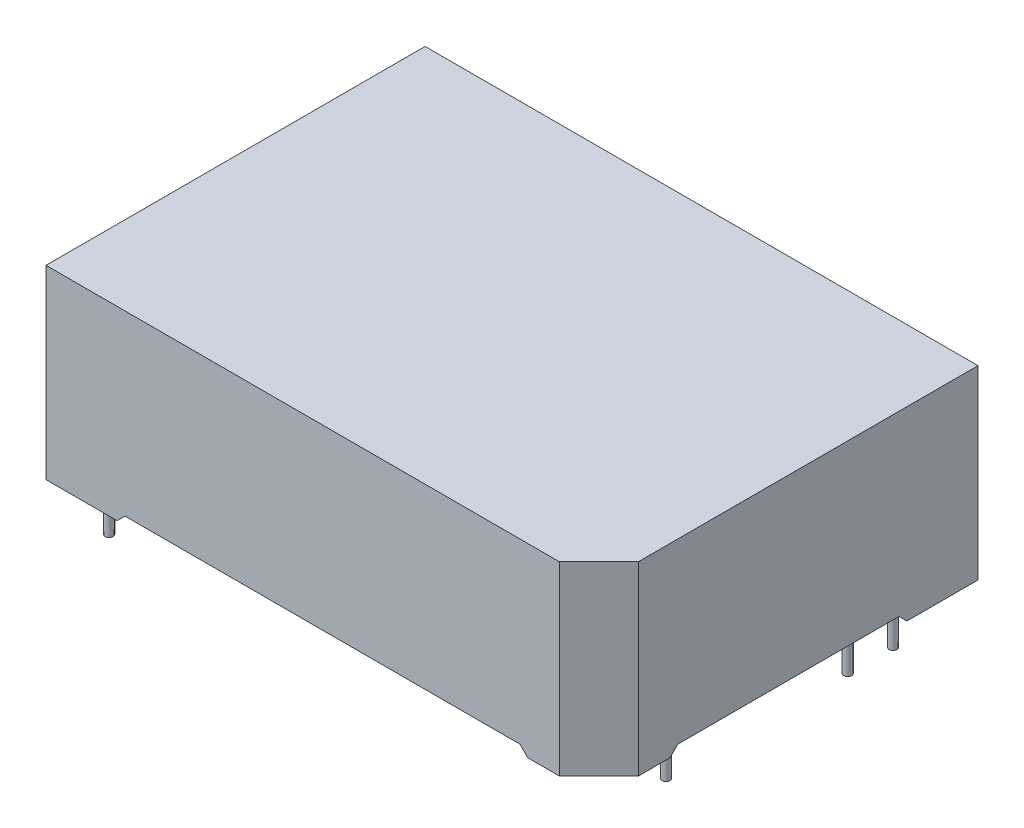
ISO-10303-21;
HEADER;
FILE_DESCRIPTION(('STEP AP214'),'2;1');
FILE_NAME('part.step','',(''),(''),'','','');
FILE_SCHEMA(('AUTOMOTIVE_DESIGN { 1 0 10303 214 1 1 1 1 }'));
ENDSEC;
DATA;
#1=APPLICATION_CONTEXT('core data for automotive mechanical design processes');
#2=APPLICATION_PROTOCOL_DEFINITION('international standard','automotive_design',2000,#1);
#3=PRODUCT_CONTEXT('',#1,'mechanical');
#4=PRODUCT('Part','Part','',(#3));
#5=PRODUCT_RELATED_PRODUCT_CATEGORY('part','',(#4));
#6=PRODUCT_DEFINITION_FORMATION('','',#4);
#7=PRODUCT_DEFINITION_CONTEXT('part definition',#1,'design');
#8=PRODUCT_DEFINITION('design','',#6,#7);
#9=PRODUCT_DEFINITION_SHAPE('','',#8);
#10=(LENGTH_UNIT() NAMED_UNIT(*) SI_UNIT(.MILLI.,.METRE.));
#11=(NAMED_UNIT(*) PLANE_ANGLE_UNIT() SI_UNIT($,.RADIAN.));
#12=(NAMED_UNIT(*) SI_UNIT($,.STERADIAN.) SOLID_ANGLE_UNIT());
#13=UNCERTAINTY_MEASURE_WITH_UNIT(LENGTH_MEASURE(1.E-05),#10,'distance_accuracy_value','');
#14=(GEOMETRIC_REPRESENTATION_CONTEXT(3) GLOBAL_UNCERTAINTY_ASSIGNED_CONTEXT((#13)) GLOBAL_UNIT_ASSIGNED_CONTEXT((#10,
#11,#12)) REPRESENTATION_CONTEXT('',''));
#15=CARTESIAN_POINT('',(0.,0.,0.));
#16=DIRECTION('',(0.,0.,1.));
#17=DIRECTION('',(1.,0.,0.));
#18=AXIS2_PLACEMENT_3D('',#15,#16,#17);
#19=CARTESIAN_POINT('',(31.,-6.,-17.25));
#20=DIRECTION('',(0.,1.,0.));
#21=DIRECTION('',(0.,0.,1.));
#22=AXIS2_PLACEMENT_3D('',#19,#20,#21);
#23=CYLINDRICAL_SURFACE('',#22,0.5);
#24=CARTESIAN_POINT('',(31.,1.,-17.25));
#25=DIRECTION('',(0.,-1.,0.));
#26=DIRECTION('',(0.,0.,-1.));
#27=AXIS2_PLACEMENT_3D('',#24,#25,#26);
#28=CIRCLE('',#27,0.5);
#29=CARTESIAN_POINT('',(31.,1.,-17.75));
#30=VERTEX_POINT('',#29);
#31=EDGE_CURVE('E11',#30,#30,#28,.T.);
#32=ORIENTED_EDGE('',*,*,#31,.T.);
#33=EDGE_LOOP('',(#32));
#34=FACE_BOUND('',#33,.T.);
#35=CARTESIAN_POINT('',(31.,-6.,-17.25));
#36=DIRECTION('',(0.,-1.,0.));
#37=DIRECTION('',(0.,0.,-1.));
#38=AXIS2_PLACEMENT_3D('',#35,#36,#37);
#39=CIRCLE('',#38,0.5);
#40=CARTESIAN_POINT('',(31.,-6.,-17.75));
#41=VERTEX_POINT('',#40);
#42=EDGE_CURVE('E500',#41,#41,#39,.T.);
#43=ORIENTED_EDGE('',*,*,#42,.F.);
#44=EDGE_LOOP('',(#43));
#45=FACE_BOUND('',#44,.T.);
#46=ADVANCED_FACE('F17',(#34,#45),#23,.T.);
#47=CARTESIAN_POINT('',(-31.,-6.,20.));
#48=DIRECTION('',(0.,1.,0.));
#49=DIRECTION('',(0.,0.,1.));
#50=AXIS2_PLACEMENT_3D('',#47,#48,#49);
#51=CYLINDRICAL_SURFACE('',#50,0.5);
#52=CARTESIAN_POINT('',(-31.,1.,20.));
#53=DIRECTION('',(0.,-1.,0.));
#54=DIRECTION('',(0.,0.,-1.));
#55=AXIS2_PLACEMENT_3D('',#52,#53,#54);
#56=CIRCLE('',#55,0.5);
#57=CARTESIAN_POINT('',(-31.,1.,19.5));
#58=VERTEX_POINT('',#57);
#59=EDGE_CURVE('E27',#58,#58,#56,.T.);
#60=ORIENTED_EDGE('',*,*,#59,.T.);
#61=EDGE_LOOP('',(#60));
#62=FACE_BOUND('',#61,.T.);
#63=CARTESIAN_POINT('',(-31.,-6.,20.));
#64=DIRECTION('',(0.,-1.,0.));
#65=DIRECTION('',(0.,0.,-1.));
#66=AXIS2_PLACEMENT_3D('',#63,#64,#65);
#67=CIRCLE('',#66,0.5);
#68=CARTESIAN_POINT('',(-31.,-6.,19.5));
#69=VERTEX_POINT('',#68);
#70=EDGE_CURVE('E496',#69,#69,#67,.T.);
#71=ORIENTED_EDGE('',*,*,#70,.F.);
#72=EDGE_LOOP('',(#71));
#73=FACE_BOUND('',#72,.T.);
#74=ADVANCED_FACE('F508',(#62,#73),#51,.T.);
#75=CARTESIAN_POINT('',(-31.,-6.,0.));
#76=DIRECTION('',(0.,1.,0.));
#77=DIRECTION('',(0.,0.,1.));
#78=AXIS2_PLACEMENT_3D('',#75,#76,#77);
#79=CYLINDRICAL_SURFACE('',#78,0.499999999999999);
#80=CARTESIAN_POINT('',(-31.,1.,0.));
#81=DIRECTION('',(0.,-1.,0.));
#82=DIRECTION('',(0.,0.,-1.));
#83=AXIS2_PLACEMENT_3D('',#80,#81,#82);
#84=CIRCLE('',#83,0.499999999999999);
#85=CARTESIAN_POINT('',(-31.,1.,-0.499999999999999));
#86=VERTEX_POINT('',#85);
#87=EDGE_CURVE('E488',#86,#86,#84,.T.);
#88=ORIENTED_EDGE('',*,*,#87,.T.);
#89=EDGE_LOOP('',(#88));
#90=FACE_BOUND('',#89,.T.);
#91=CARTESIAN_POINT('',(-31.,-6.,0.));
#92=DIRECTION('',(0.,-1.,0.));
#93=DIRECTION('',(0.,0.,-1.));
#94=AXIS2_PLACEMENT_3D('',#91,#92,#93);
#95=CIRCLE('',#94,0.499999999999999);
#96=CARTESIAN_POINT('',(-31.,-6.,-0.499999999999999));
#97=VERTEX_POINT('',#96);
#98=EDGE_CURVE('E491',#97,#97,#95,.T.);
#99=ORIENTED_EDGE('',*,*,#98,.F.);
#100=EDGE_LOOP('',(#99));
#101=FACE_BOUND('',#100,.T.);
#102=ADVANCED_FACE('F515',(#90,#101),#79,.T.);
#103=CARTESIAN_POINT('',(-31.,-6.,-20.));
#104=DIRECTION('',(0.,1.,0.));
#105=DIRECTION('',(0.,0.,1.));
#106=AXIS2_PLACEMENT_3D('',#103,#104,#105);
#107=CYLINDRICAL_SURFACE('',#106,0.5);
#108=CARTESIAN_POINT('',(-31.,1.,-20.));
#109=DIRECTION('',(0.,-1.,0.));
#110=DIRECTION('',(0.,0.,-1.));
#111=AXIS2_PLACEMENT_3D('',#108,#109,#110);
#112=CIRCLE('',#111,0.5);
#113=CARTESIAN_POINT('',(-31.,1.,-20.5));
#114=VERTEX_POINT('',#113);
#115=EDGE_CURVE('E482',#114,#114,#112,.T.);
#116=ORIENTED_EDGE('',*,*,#115,.T.);
#117=EDGE_LOOP('',(#116));
#118=FACE_BOUND('',#117,.T.);
#119=CARTESIAN_POINT('',(-31.,-6.,-20.));
#120=DIRECTION('',(0.,-1.,0.));
#121=DIRECTION('',(0.,0.,1.));
#122=AXIS2_PLACEMENT_3D('',#119,#120,#121);
#123=CIRCLE('',#122,0.5);
#124=CARTESIAN_POINT('',(-31.,-6.,-19.5));
#125=VERTEX_POINT('',#124);
#126=EDGE_CURVE('E485',#125,#125,#123,.T.);
#127=ORIENTED_EDGE('',*,*,#126,.F.);
#128=EDGE_LOOP('',(#127));
#129=FACE_BOUND('',#128,.T.);
#130=ADVANCED_FACE('F521',(#118,#129),#107,.T.);
#131=CARTESIAN_POINT('',(31.,-6.,11.5));
#132=DIRECTION('',(0.,1.,0.));
#133=DIRECTION('',(0.,0.,1.));
#134=AXIS2_PLACEMENT_3D('',#131,#132,#133);
#135=CYLINDRICAL_SURFACE('',#134,0.499999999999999);
#136=CARTESIAN_POINT('',(31.,1.,11.5));
#137=DIRECTION('',(0.,-1.,0.));
#138=DIRECTION('',(0.,0.,-1.));
#139=AXIS2_PLACEMENT_3D('',#136,#137,#138);
#140=CIRCLE('',#139,0.499999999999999);
#141=CARTESIAN_POINT('',(31.,1.,11.));
#142=VERTEX_POINT('',#141);
#143=EDGE_CURVE('E476',#142,#142,#140,.T.);
#144=ORIENTED_EDGE('',*,*,#143,.T.);
#145=EDGE_LOOP('',(#144));
#146=FACE_BOUND('',#145,.T.);
#147=CARTESIAN_POINT('',(31.,-6.,11.5));
#148=DIRECTION('',(0.,-1.,0.));
#149=DIRECTION('',(0.,0.,-1.));
#150=AXIS2_PLACEMENT_3D('',#147,#148,#149);
#151=CIRCLE('',#150,0.499999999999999);
#152=CARTESIAN_POINT('',(31.,-6.,11.));
#153=VERTEX_POINT('',#152);
#154=EDGE_CURVE('E479',#153,#153,#151,.T.);
#155=ORIENTED_EDGE('',*,*,#154,.F.);
#156=EDGE_LOOP('',(#155));
#157=FACE_BOUND('',#156,.T.);
#158=ADVANCED_FACE('F525',(#146,#157),#135,.T.);
#159=CARTESIAN_POINT('',(31.,-6.,-11.5));
#160=DIRECTION('',(0.,1.,0.));
#161=DIRECTION('',(0.,0.,1.));
#162=AXIS2_PLACEMENT_3D('',#159,#160,#161);
#163=CYLINDRICAL_SURFACE('',#162,0.499999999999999);
#164=CARTESIAN_POINT('',(31.,1.,-11.5));
#165=DIRECTION('',(0.,-1.,0.));
#166=DIRECTION('',(0.,0.,-1.));
#167=AXIS2_PLACEMENT_3D('',#164,#165,#166);
#168=CIRCLE('',#167,0.499999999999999);
#169=CARTESIAN_POINT('',(31.,1.,-12.));
#170=VERTEX_POINT('',#169);
#171=EDGE_CURVE('E455',#170,#170,#168,.T.);
#172=ORIENTED_EDGE('',*,*,#171,.T.);
#173=EDGE_LOOP('',(#172));
#174=FACE_BOUND('',#173,.T.);
#175=CARTESIAN_POINT('',(31.,-6.,-11.5));
#176=DIRECTION('',(0.,-1.,0.));
#177=DIRECTION('',(0.,0.,1.));
#178=AXIS2_PLACEMENT_3D('',#175,#176,#177);
#179=CIRCLE('',#178,0.499999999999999);
#180=CARTESIAN_POINT('',(31.,-6.,-11.));
#181=VERTEX_POINT('',#180);
#182=EDGE_CURVE('E412',#181,#181,#179,.T.);
#183=ORIENTED_EDGE('',*,*,#182,.F.);
#184=EDGE_LOOP('',(#183));
#185=FACE_BOUND('',#184,.T.);
#186=ADVANCED_FACE('F529',(#174,#185),#163,.T.);
#187=CARTESIAN_POINT('',(-35.,0.,24.));
#188=DIRECTION('',(0.,1.,0.));
#189=DIRECTION('',(0.,0.,1.));
#190=AXIS2_PLACEMENT_3D('',#187,#188,#189);
#191=PLANE('',#190);
#192=DIRECTION('',(0.,0.,1.));
#193=VECTOR('',#192,1.);
#194=CARTESIAN_POINT('',(34.,0.,14.));
#195=LINE('',#194,#193);
#196=CARTESIAN_POINT('',(34.,0.,15.));
#197=VERTEX_POINT('',#196);
#198=CARTESIAN_POINT('',(34.,0.,18.585786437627));
#199=VERTEX_POINT('',#198);
#200=EDGE_CURVE('E36',#197,#199,#195,.T.);
#201=ORIENTED_EDGE('',*,*,#200,.F.);
#202=DIRECTION('',(1.,0.,0.));
#203=VECTOR('',#202,1.);
#204=CARTESIAN_POINT('',(-35.,0.,15.));
#205=LINE('',#204,#203);
#206=CARTESIAN_POINT('',(35.,0.,15.));
#207=VERTEX_POINT('',#206);
#208=EDGE_CURVE('E451',#197,#207,#205,.T.);
#209=ORIENTED_EDGE('',*,*,#208,.T.);
#210=DIRECTION('',(0.,0.,-1.));
#211=VECTOR('',#210,1.);
#212=CARTESIAN_POINT('',(35.,0.,-24.));
#213=LINE('',#212,#211);
#214=CARTESIAN_POINT('',(35.,0.,19.0000000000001));
#215=VERTEX_POINT('',#214);
#216=EDGE_CURVE('E345',#215,#207,#213,.T.);
#217=ORIENTED_EDGE('',*,*,#216,.F.);
#218=DIRECTION('',(0.707106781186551,0.,-0.707106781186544));
#219=VECTOR('',#218,1.);
#220=CARTESIAN_POINT('',(35.,0.,19.0000000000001));
#221=LINE('',#220,#219);
#222=CARTESIAN_POINT('',(30.,0.,24.));
#223=VERTEX_POINT('',#222);
#224=EDGE_CURVE('E418',#223,#215,#221,.T.);
#225=ORIENTED_EDGE('',*,*,#224,.F.);
#226=DIRECTION('',(1.,0.,0.));
#227=VECTOR('',#226,1.);
#228=CARTESIAN_POINT('',(-35.,0.,24.));
#229=LINE('',#228,#227);
#230=CARTESIAN_POINT('',(26.,0.,24.));
#231=VERTEX_POINT('',#230);
#232=EDGE_CURVE('E407',#231,#223,#229,.T.);
#233=ORIENTED_EDGE('',*,*,#232,.F.);
#234=DIRECTION('',(0.,0.,-1.));
#235=VECTOR('',#234,1.);
#236=CARTESIAN_POINT('',(26.,0.,24.));
#237=LINE('',#236,#235);
#238=CARTESIAN_POINT('',(26.,0.,23.));
#239=VERTEX_POINT('',#238);
#240=EDGE_CURVE('E381',#231,#239,#237,.T.);
#241=ORIENTED_EDGE('',*,*,#240,.T.);
#242=DIRECTION('',(-1.,0.,0.));
#243=VECTOR('',#242,1.);
#244=CARTESIAN_POINT('',(29.5857864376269,0.,23.));
#245=LINE('',#244,#243);
#246=CARTESIAN_POINT('',(29.5857864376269,0.,23.));
#247=VERTEX_POINT('',#246);
#248=EDGE_CURVE('E355',#247,#239,#245,.T.);
#249=ORIENTED_EDGE('',*,*,#248,.F.);
#250=DIRECTION('',(-0.707106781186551,0.,0.707106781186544));
#251=VECTOR('',#250,1.);
#252=CARTESIAN_POINT('',(34.,0.,18.585786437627));
#253=LINE('',#252,#251);
#254=EDGE_CURVE('E367',#199,#247,#253,.T.);
#255=ORIENTED_EDGE('',*,*,#254,.F.);
#256=EDGE_LOOP('',(#201,#209,#217,#225,#233,#241,#249,#255));
#257=FACE_BOUND('',#256,.T.);
#258=ADVANCED_FACE('F452',(#257),#191,.F.);
#259=CARTESIAN_POINT('',(-35.,0.,24.));
#260=DIRECTION('',(0.,1.,0.));
#261=DIRECTION('',(0.,0.,1.));
#262=AXIS2_PLACEMENT_3D('',#259,#260,#261);
#263=PLANE('',#262);
#264=DIRECTION('',(1.,0.,0.));
#265=VECTOR('',#264,1.);
#266=CARTESIAN_POINT('',(25.,0.,-23.));
#267=LINE('',#266,#265);
#268=CARTESIAN_POINT('',(26.,0.,-23.));
#269=VERTEX_POINT('',#268);
#270=CARTESIAN_POINT('',(34.,0.,-23.));
#271=VERTEX_POINT('',#270);
#272=EDGE_CURVE('E269',#269,#271,#267,.T.);
#273=ORIENTED_EDGE('',*,*,#272,.F.);
#274=DIRECTION('',(0.,0.,-1.));
#275=VECTOR('',#274,1.);
#276=CARTESIAN_POINT('',(26.,0.,24.));
#277=LINE('',#276,#275);
#278=CARTESIAN_POINT('',(26.,0.,-24.));
#279=VERTEX_POINT('',#278);
#280=EDGE_CURVE('E378',#269,#279,#277,.T.);
#281=ORIENTED_EDGE('',*,*,#280,.T.);
#282=DIRECTION('',(-1.,0.,0.));
#283=VECTOR('',#282,1.);
#284=CARTESIAN_POINT('',(-35.,0.,-24.));
#285=LINE('',#284,#283);
#286=CARTESIAN_POINT('',(35.,0.,-24.));
#287=VERTEX_POINT('',#286);
#288=EDGE_CURVE('E359',#287,#279,#285,.T.);
#289=ORIENTED_EDGE('',*,*,#288,.F.);
#290=DIRECTION('',(0.,0.,-1.));
#291=VECTOR('',#290,1.);
#292=CARTESIAN_POINT('',(35.,0.,-24.));
#293=LINE('',#292,#291);
#294=CARTESIAN_POINT('',(35.,0.,-15.));
#295=VERTEX_POINT('',#294);
#296=EDGE_CURVE('E384',#295,#287,#293,.T.);
#297=ORIENTED_EDGE('',*,*,#296,.F.);
#298=DIRECTION('',(-1.,0.,0.));
#299=VECTOR('',#298,1.);
#300=CARTESIAN_POINT('',(-35.,0.,-15.));
#301=LINE('',#300,#299);
#302=CARTESIAN_POINT('',(34.,0.,-15.));
#303=VERTEX_POINT('',#302);
#304=EDGE_CURVE('E382',#295,#303,#301,.T.);
#305=ORIENTED_EDGE('',*,*,#304,.T.);
#306=DIRECTION('',(0.,0.,1.));
#307=VECTOR('',#306,1.);
#308=CARTESIAN_POINT('',(34.,0.,-23.));
#309=LINE('',#308,#307);
#310=EDGE_CURVE('E259',#271,#303,#309,.T.);
#311=ORIENTED_EDGE('',*,*,#310,.F.);
#312=EDGE_LOOP('',(#273,#281,#289,#297,#305,#311));
#313=FACE_BOUND('',#312,.T.);
#314=ADVANCED_FACE('F536',(#313),#263,.F.);
#315=CARTESIAN_POINT('',(-35.,0.,24.));
#316=DIRECTION('',(0.,1.,0.));
#317=DIRECTION('',(0.,0.,1.));
#318=AXIS2_PLACEMENT_3D('',#315,#316,#317);
#319=PLANE('',#318);
#320=DIRECTION('',(-1.,0.,0.));
#321=VECTOR('',#320,1.);
#322=CARTESIAN_POINT('',(-35.,0.,-24.));
#323=LINE('',#322,#321);
#324=CARTESIAN_POINT('',(-26.,0.,-24.));
#325=VERTEX_POINT('',#324);
#326=CARTESIAN_POINT('',(-35.,0.,-24.));
#327=VERTEX_POINT('',#326);
#328=EDGE_CURVE('E342',#325,#327,#323,.T.);
#329=ORIENTED_EDGE('',*,*,#328,.F.);
#330=DIRECTION('',(0.,0.,1.));
#331=VECTOR('',#330,1.);
#332=CARTESIAN_POINT('',(-26.,0.,24.));
#333=LINE('',#332,#331);
#334=CARTESIAN_POINT('',(-26.,0.,-23.));
#335=VERTEX_POINT('',#334);
#336=EDGE_CURVE('E339',#325,#335,#333,.T.);
#337=ORIENTED_EDGE('',*,*,#336,.T.);
#338=DIRECTION('',(1.,0.,0.));
#339=VECTOR('',#338,1.);
#340=CARTESIAN_POINT('',(-34.,0.,-23.));
#341=LINE('',#340,#339);
#342=CARTESIAN_POINT('',(-34.,0.,-23.));
#343=VERTEX_POINT('',#342);
#344=EDGE_CURVE('E273',#343,#335,#341,.T.);
#345=ORIENTED_EDGE('',*,*,#344,.F.);
#346=DIRECTION('',(0.,0.,-1.));
#347=VECTOR('',#346,1.);
#348=CARTESIAN_POINT('',(-34.,0.,-14.));
#349=LINE('',#348,#347);
#350=CARTESIAN_POINT('',(-34.,0.,-15.));
#351=VERTEX_POINT('',#350);
#352=EDGE_CURVE('E283',#351,#343,#349,.T.);
#353=ORIENTED_EDGE('',*,*,#352,.F.);
#354=DIRECTION('',(-1.,0.,0.));
#355=VECTOR('',#354,1.);
#356=CARTESIAN_POINT('',(-35.,0.,-15.));
#357=LINE('',#356,#355);
#358=CARTESIAN_POINT('',(-35.,0.,-15.));
#359=VERTEX_POINT('',#358);
#360=EDGE_CURVE('E303',#351,#359,#357,.T.);
#361=ORIENTED_EDGE('',*,*,#360,.T.);
#362=DIRECTION('',(0.,0.,1.));
#363=VECTOR('',#362,1.);
#364=CARTESIAN_POINT('',(-35.,0.,-24.));
#365=LINE('',#364,#363);
#366=EDGE_CURVE('E316',#327,#359,#365,.T.);
#367=ORIENTED_EDGE('',*,*,#366,.F.);
#368=EDGE_LOOP('',(#329,#337,#345,#353,#361,#367));
#369=FACE_BOUND('',#368,.T.);
#370=ADVANCED_FACE('F539',(#369),#319,.F.);
#371=CARTESIAN_POINT('',(-35.,0.,24.));
#372=DIRECTION('',(0.,1.,0.));
#373=DIRECTION('',(0.,0.,1.));
#374=AXIS2_PLACEMENT_3D('',#371,#372,#373);
#375=PLANE('',#374);
#376=DIRECTION('',(0.,0.,1.));
#377=VECTOR('',#376,1.);
#378=CARTESIAN_POINT('',(-35.,0.,-24.));
#379=LINE('',#378,#377);
#380=CARTESIAN_POINT('',(-35.,0.,15.));
#381=VERTEX_POINT('',#380);
#382=CARTESIAN_POINT('',(-35.,0.,24.));
#383=VERTEX_POINT('',#382);
#384=EDGE_CURVE('E299',#381,#383,#379,.T.);
#385=ORIENTED_EDGE('',*,*,#384,.F.);
#386=DIRECTION('',(1.,0.,0.));
#387=VECTOR('',#386,1.);
#388=CARTESIAN_POINT('',(-35.,0.,15.));
#389=LINE('',#388,#387);
#390=CARTESIAN_POINT('',(-34.,0.,15.));
#391=VERTEX_POINT('',#390);
#392=EDGE_CURVE('E296',#381,#391,#389,.T.);
#393=ORIENTED_EDGE('',*,*,#392,.T.);
#394=DIRECTION('',(0.,0.,-1.));
#395=VECTOR('',#394,1.);
#396=CARTESIAN_POINT('',(-34.,0.,23.));
#397=LINE('',#396,#395);
#398=CARTESIAN_POINT('',(-34.,0.,23.));
#399=VERTEX_POINT('',#398);
#400=EDGE_CURVE('E286',#399,#391,#397,.T.);
#401=ORIENTED_EDGE('',*,*,#400,.F.);
#402=DIRECTION('',(-1.,0.,0.));
#403=VECTOR('',#402,1.);
#404=CARTESIAN_POINT('',(-25.,0.,23.));
#405=LINE('',#404,#403);
#406=CARTESIAN_POINT('',(-26.,0.,23.));
#407=VERTEX_POINT('',#406);
#408=EDGE_CURVE('E209',#407,#399,#405,.T.);
#409=ORIENTED_EDGE('',*,*,#408,.F.);
#410=DIRECTION('',(0.,0.,1.));
#411=VECTOR('',#410,1.);
#412=CARTESIAN_POINT('',(-26.,0.,24.));
#413=LINE('',#412,#411);
#414=CARTESIAN_POINT('',(-26.,0.,24.));
#415=VERTEX_POINT('',#414);
#416=EDGE_CURVE('E208',#407,#415,#413,.T.);
#417=ORIENTED_EDGE('',*,*,#416,.T.);
#418=DIRECTION('',(1.,0.,0.));
#419=VECTOR('',#418,1.);
#420=CARTESIAN_POINT('',(-35.,0.,24.));
#421=LINE('',#420,#419);
#422=EDGE_CURVE('E400',#383,#415,#421,.T.);
#423=ORIENTED_EDGE('',*,*,#422,.F.);
#424=EDGE_LOOP('',(#385,#393,#401,#409,#417,#423));
#425=FACE_BOUND('',#424,.T.);
#426=ADVANCED_FACE('F297',(#425),#375,.F.);
#427=CARTESIAN_POINT('',(-35.,23.5,-24.));
#428=DIRECTION('',(1.,0.,0.));
#429=DIRECTION('',(0.,0.,-1.));
#430=AXIS2_PLACEMENT_3D('',#427,#428,#429);
#431=PLANE('',#430);
#432=DIRECTION('',(0.,0.,-1.));
#433=VECTOR('',#432,1.);
#434=CARTESIAN_POINT('',(-35.,1.,14.));
#435=LINE('',#434,#433);
#436=CARTESIAN_POINT('',(-35.,1.,14.));
#437=VERTEX_POINT('',#436);
#438=CARTESIAN_POINT('',(-35.,1.,-14.));
#439=VERTEX_POINT('',#438);
#440=EDGE_CURVE('E221',#437,#439,#435,.T.);
#441=ORIENTED_EDGE('',*,*,#440,.F.);
#442=DIRECTION('',(0.,-0.707106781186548,0.707106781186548));
#443=VECTOR('',#442,1.);
#444=CARTESIAN_POINT('',(-35.,1.,14.));
#445=LINE('',#444,#443);
#446=EDGE_CURVE('E306',#437,#381,#445,.T.);
#447=ORIENTED_EDGE('',*,*,#446,.T.);
#448=ORIENTED_EDGE('',*,*,#384,.T.);
#449=DIRECTION('',(0.,-1.,0.));
#450=VECTOR('',#449,1.);
#451=CARTESIAN_POINT('',(-35.,23.5,24.));
#452=LINE('',#451,#450);
#453=CARTESIAN_POINT('',(-35.,23.5,24.));
#454=VERTEX_POINT('',#453);
#455=EDGE_CURVE('E401',#454,#383,#452,.T.);
#456=ORIENTED_EDGE('',*,*,#455,.F.);
#457=DIRECTION('',(0.,0.,1.));
#458=VECTOR('',#457,1.);
#459=CARTESIAN_POINT('',(-35.,23.5,-24.));
#460=LINE('',#459,#458);
#461=CARTESIAN_POINT('',(-35.,23.5,-24.));
#462=VERTEX_POINT('',#461);
#463=EDGE_CURVE('E360',#462,#454,#460,.T.);
#464=ORIENTED_EDGE('',*,*,#463,.F.);
#465=DIRECTION('',(0.,-1.,0.));
#466=VECTOR('',#465,1.);
#467=CARTESIAN_POINT('',(-35.,23.5,-24.));
#468=LINE('',#467,#466);
#469=EDGE_CURVE('E397',#462,#327,#468,.T.);
#470=ORIENTED_EDGE('',*,*,#469,.T.);
#471=ORIENTED_EDGE('',*,*,#366,.T.);
#472=DIRECTION('',(0.,0.707106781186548,0.707106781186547));
#473=VECTOR('',#472,1.);
#474=CARTESIAN_POINT('',(-35.,1.,-14.));
#475=LINE('',#474,#473);
#476=EDGE_CURVE('E312',#359,#439,#475,.T.);
#477=ORIENTED_EDGE('',*,*,#476,.T.);
#478=EDGE_LOOP('',(#441,#447,#448,#456,#464,#470,#471,#477));
#479=FACE_BOUND('',#478,.T.);
#480=ADVANCED_FACE('F313',(#479),#431,.F.);
#481=CARTESIAN_POINT('',(-35.,23.5,24.));
#482=DIRECTION('',(0.,0.,-1.));
#483=DIRECTION('',(-1.,0.,0.));
#484=AXIS2_PLACEMENT_3D('',#481,#482,#483);
#485=PLANE('',#484);
#486=DIRECTION('',(-1.,0.,0.));
#487=VECTOR('',#486,1.);
#488=CARTESIAN_POINT('',(-25.,1.,24.));
#489=LINE('',#488,#487);
#490=CARTESIAN_POINT('',(25.,1.,24.));
#491=VERTEX_POINT('',#490);
#492=CARTESIAN_POINT('',(-25.,1.,24.));
#493=VERTEX_POINT('',#492);
#494=EDGE_CURVE('E213',#491,#493,#489,.T.);
#495=ORIENTED_EDGE('',*,*,#494,.F.);
#496=DIRECTION('',(0.707106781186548,-0.707106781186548,0.));
#497=VECTOR('',#496,1.);
#498=CARTESIAN_POINT('',(25.,1.,24.));
#499=LINE('',#498,#497);
#500=EDGE_CURVE('E320',#491,#231,#499,.T.);
#501=ORIENTED_EDGE('',*,*,#500,.T.);
#502=ORIENTED_EDGE('',*,*,#232,.T.);
#503=DIRECTION('',(0.,-1.,0.));
#504=VECTOR('',#503,1.);
#505=CARTESIAN_POINT('',(30.,23.5,24.));
#506=LINE('',#505,#504);
#507=CARTESIAN_POINT('',(30.,23.5,24.));
#508=VERTEX_POINT('',#507);
#509=EDGE_CURVE('E415',#508,#223,#506,.T.);
#510=ORIENTED_EDGE('',*,*,#509,.F.);
#511=DIRECTION('',(1.,0.,0.));
#512=VECTOR('',#511,1.);
#513=CARTESIAN_POINT('',(-35.,23.5,24.));
#514=LINE('',#513,#512);
#515=EDGE_CURVE('E409',#454,#508,#514,.T.);
#516=ORIENTED_EDGE('',*,*,#515,.F.);
#517=ORIENTED_EDGE('',*,*,#455,.T.);
#518=ORIENTED_EDGE('',*,*,#422,.T.);
#519=DIRECTION('',(0.707106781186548,0.707106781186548,0.));
#520=VECTOR('',#519,1.);
#521=CARTESIAN_POINT('',(-25.,1.,24.));
#522=LINE('',#521,#520);
#523=EDGE_CURVE('E402',#415,#493,#522,.T.);
#524=ORIENTED_EDGE('',*,*,#523,.T.);
#525=EDGE_LOOP('',(#495,#501,#502,#510,#516,#517,#518,#524));
#526=FACE_BOUND('',#525,.T.);
#527=ADVANCED_FACE('F445',(#526),#485,.F.);
#528=CARTESIAN_POINT('',(35.,23.5,19.0000000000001));
#529=DIRECTION('',(-0.707106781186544,0.,-0.707106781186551));
#530=DIRECTION('',(-0.707106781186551,0.,0.707106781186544));
#531=AXIS2_PLACEMENT_3D('',#528,#529,#530);
#532=PLANE('',#531);
#533=ORIENTED_EDGE('',*,*,#224,.T.);
#534=DIRECTION('',(0.,-1.,0.));
#535=VECTOR('',#534,1.);
#536=CARTESIAN_POINT('',(35.,23.5,19.0000000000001));
#537=LINE('',#536,#535);
#538=CARTESIAN_POINT('',(35.,23.5,19.0000000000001));
#539=VERTEX_POINT('',#538);
#540=EDGE_CURVE('E388',#539,#215,#537,.T.);
#541=ORIENTED_EDGE('',*,*,#540,.F.);
#542=DIRECTION('',(0.707106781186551,0.,-0.707106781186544));
#543=VECTOR('',#542,1.);
#544=CARTESIAN_POINT('',(35.,23.5,19.0000000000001));
#545=LINE('',#544,#543);
#546=EDGE_CURVE('E420',#508,#539,#545,.T.);
#547=ORIENTED_EDGE('',*,*,#546,.F.);
#548=ORIENTED_EDGE('',*,*,#509,.T.);
#549=EDGE_LOOP('',(#533,#541,#547,#548));
#550=FACE_BOUND('',#549,.T.);
#551=ADVANCED_FACE('F448',(#550),#532,.F.);
#552=CARTESIAN_POINT('',(35.,23.5,-24.));
#553=DIRECTION('',(-1.,0.,0.));
#554=DIRECTION('',(0.,0.,1.));
#555=AXIS2_PLACEMENT_3D('',#552,#553,#554);
#556=PLANE('',#555);
#557=DIRECTION('',(0.,0.,1.));
#558=VECTOR('',#557,1.);
#559=CARTESIAN_POINT('',(35.,1.,14.));
#560=LINE('',#559,#558);
#561=CARTESIAN_POINT('',(35.,1.,-14.));
#562=VERTEX_POINT('',#561);
#563=CARTESIAN_POINT('',(35.,1.,14.));
#564=VERTEX_POINT('',#563);
#565=EDGE_CURVE('E238',#562,#564,#560,.T.);
#566=ORIENTED_EDGE('',*,*,#565,.F.);
#567=DIRECTION('',(0.,-0.707106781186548,-0.707106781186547));
#568=VECTOR('',#567,1.);
#569=CARTESIAN_POINT('',(35.,1.,-14.));
#570=LINE('',#569,#568);
#571=EDGE_CURVE('E387',#562,#295,#570,.T.);
#572=ORIENTED_EDGE('',*,*,#571,.T.);
#573=ORIENTED_EDGE('',*,*,#296,.T.);
#574=DIRECTION('',(0.,-1.,0.));
#575=VECTOR('',#574,1.);
#576=CARTESIAN_POINT('',(35.,23.5,-24.));
#577=LINE('',#576,#575);
#578=CARTESIAN_POINT('',(35.,23.5,-24.));
#579=VERTEX_POINT('',#578);
#580=EDGE_CURVE('E347',#579,#287,#577,.T.);
#581=ORIENTED_EDGE('',*,*,#580,.F.);
#582=DIRECTION('',(0.,0.,-1.));
#583=VECTOR('',#582,1.);
#584=CARTESIAN_POINT('',(35.,23.5,-24.));
#585=LINE('',#584,#583);
#586=EDGE_CURVE('E354',#539,#579,#585,.T.);
#587=ORIENTED_EDGE('',*,*,#586,.F.);
#588=ORIENTED_EDGE('',*,*,#540,.T.);
#589=ORIENTED_EDGE('',*,*,#216,.T.);
#590=DIRECTION('',(0.,0.707106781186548,-0.707106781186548));
#591=VECTOR('',#590,1.);
#592=CARTESIAN_POINT('',(35.,1.,14.));
#593=LINE('',#592,#591);
#594=EDGE_CURVE('E341',#207,#564,#593,.T.);
#595=ORIENTED_EDGE('',*,*,#594,.T.);
#596=EDGE_LOOP('',(#566,#572,#573,#581,#587,#588,#589,#595));
#597=FACE_BOUND('',#596,.T.);
#598=ADVANCED_FACE('F437',(#597),#556,.F.);
#599=CARTESIAN_POINT('',(-35.,23.5,-24.));
#600=DIRECTION('',(0.,0.,1.));
#601=DIRECTION('',(1.,0.,0.));
#602=AXIS2_PLACEMENT_3D('',#599,#600,#601);
#603=PLANE('',#602);
#604=DIRECTION('',(1.,0.,0.));
#605=VECTOR('',#604,1.);
#606=CARTESIAN_POINT('',(25.,1.,-24.));
#607=LINE('',#606,#605);
#608=CARTESIAN_POINT('',(-25.,1.,-24.));
#609=VERTEX_POINT('',#608);
#610=CARTESIAN_POINT('',(25.,1.,-24.));
#611=VERTEX_POINT('',#610);
#612=EDGE_CURVE('E230',#609,#611,#607,.T.);
#613=ORIENTED_EDGE('',*,*,#612,.F.);
#614=DIRECTION('',(-0.707106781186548,-0.707106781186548,0.));
#615=VECTOR('',#614,1.);
#616=CARTESIAN_POINT('',(-25.,0.999999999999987,-24.));
#617=LINE('',#616,#615);
#618=EDGE_CURVE('E338',#609,#325,#617,.T.);
#619=ORIENTED_EDGE('',*,*,#618,.T.);
#620=ORIENTED_EDGE('',*,*,#328,.T.);
#621=ORIENTED_EDGE('',*,*,#469,.F.);
#622=DIRECTION('',(-1.,0.,0.));
#623=VECTOR('',#622,1.);
#624=CARTESIAN_POINT('',(-35.,23.5,-24.));
#625=LINE('',#624,#623);
#626=EDGE_CURVE('E351',#579,#462,#625,.T.);
#627=ORIENTED_EDGE('',*,*,#626,.F.);
#628=ORIENTED_EDGE('',*,*,#580,.T.);
#629=ORIENTED_EDGE('',*,*,#288,.T.);
#630=DIRECTION('',(-0.707106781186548,0.707106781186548,0.));
#631=VECTOR('',#630,1.);
#632=CARTESIAN_POINT('',(25.,0.999999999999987,-24.));
#633=LINE('',#632,#631);
#634=EDGE_CURVE('E356',#279,#611,#633,.T.);
#635=ORIENTED_EDGE('',*,*,#634,.T.);
#636=EDGE_LOOP('',(#613,#619,#620,#621,#627,#628,#629,#635));
#637=FACE_BOUND('',#636,.T.);
#638=ADVANCED_FACE('F439',(#637),#603,.F.);
#639=CARTESIAN_POINT('',(-35.,23.5,24.));
#640=DIRECTION('',(0.,1.,0.));
#641=DIRECTION('',(0.,0.,1.));
#642=AXIS2_PLACEMENT_3D('',#639,#640,#641);
#643=PLANE('',#642);
#644=ORIENTED_EDGE('',*,*,#463,.T.);
#645=ORIENTED_EDGE('',*,*,#515,.T.);
#646=ORIENTED_EDGE('',*,*,#546,.T.);
#647=ORIENTED_EDGE('',*,*,#586,.T.);
#648=ORIENTED_EDGE('',*,*,#626,.T.);
#649=EDGE_LOOP('',(#644,#645,#646,#647,#648));
#650=FACE_BOUND('',#649,.T.);
#651=ADVANCED_FACE('F432',(#650),#643,.T.);
#652=CARTESIAN_POINT('',(29.5857864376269,1.,23.));
#653=DIRECTION('',(0.,0.,1.));
#654=DIRECTION('',(1.,0.,0.));
#655=AXIS2_PLACEMENT_3D('',#652,#653,#654);
#656=PLANE('',#655);
#657=ORIENTED_EDGE('',*,*,#248,.T.);
#658=DIRECTION('',(-0.707106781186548,0.707106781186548,0.));
#659=VECTOR('',#658,1.);
#660=CARTESIAN_POINT('',(25.,1.,23.));
#661=LINE('',#660,#659);
#662=CARTESIAN_POINT('',(25.,1.,23.));
#663=VERTEX_POINT('',#662);
#664=EDGE_CURVE('E361',#239,#663,#661,.T.);
#665=ORIENTED_EDGE('',*,*,#664,.T.);
#666=DIRECTION('',(-1.,0.,0.));
#667=VECTOR('',#666,1.);
#668=CARTESIAN_POINT('',(29.5857864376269,1.,23.));
#669=LINE('',#668,#667);
#670=CARTESIAN_POINT('',(29.5857864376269,1.,23.));
#671=VERTEX_POINT('',#670);
#672=EDGE_CURVE('E248',#671,#663,#669,.T.);
#673=ORIENTED_EDGE('',*,*,#672,.F.);
#674=DIRECTION('',(0.,-1.,0.));
#675=VECTOR('',#674,1.);
#676=CARTESIAN_POINT('',(29.5857864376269,1.,23.));
#677=LINE('',#676,#675);
#678=EDGE_CURVE('E364',#671,#247,#677,.T.);
#679=ORIENTED_EDGE('',*,*,#678,.T.);
#680=EDGE_LOOP('',(#657,#665,#673,#679));
#681=FACE_BOUND('',#680,.T.);
#682=ADVANCED_FACE('F464',(#681),#656,.F.);
#683=CARTESIAN_POINT('',(34.,1.,18.585786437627));
#684=DIRECTION('',(0.707106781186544,0.,0.707106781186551));
#685=DIRECTION('',(0.707106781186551,0.,-0.707106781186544));
#686=AXIS2_PLACEMENT_3D('',#683,#684,#685);
#687=PLANE('',#686);
#688=ORIENTED_EDGE('',*,*,#254,.T.);
#689=ORIENTED_EDGE('',*,*,#678,.F.);
#690=DIRECTION('',(-0.707106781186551,0.,0.707106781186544));
#691=VECTOR('',#690,1.);
#692=CARTESIAN_POINT('',(34.,1.,18.585786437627));
#693=LINE('',#692,#691);
#694=CARTESIAN_POINT('',(34.,1.,18.585786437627));
#695=VERTEX_POINT('',#694);
#696=EDGE_CURVE('E245',#695,#671,#693,.T.);
#697=ORIENTED_EDGE('',*,*,#696,.F.);
#698=DIRECTION('',(0.,-1.,0.));
#699=VECTOR('',#698,1.);
#700=CARTESIAN_POINT('',(34.,1.,18.585786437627));
#701=LINE('',#700,#699);
#702=EDGE_CURVE('E252',#695,#199,#701,.T.);
#703=ORIENTED_EDGE('',*,*,#702,.T.);
#704=EDGE_LOOP('',(#688,#689,#697,#703));
#705=FACE_BOUND('',#704,.T.);
#706=ADVANCED_FACE('F461',(#705),#687,.F.);
#707=CARTESIAN_POINT('',(34.,1.,14.));
#708=DIRECTION('',(1.,0.,0.));
#709=DIRECTION('',(0.,0.,-1.));
#710=AXIS2_PLACEMENT_3D('',#707,#708,#709);
#711=PLANE('',#710);
#712=DIRECTION('',(0.,0.,1.));
#713=VECTOR('',#712,1.);
#714=CARTESIAN_POINT('',(34.,1.,14.));
#715=LINE('',#714,#713);
#716=CARTESIAN_POINT('',(34.,1.,14.));
#717=VERTEX_POINT('',#716);
#718=EDGE_CURVE('E241',#717,#695,#715,.T.);
#719=ORIENTED_EDGE('',*,*,#718,.F.);
#720=DIRECTION('',(0.,-0.707106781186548,0.707106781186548));
#721=VECTOR('',#720,1.);
#722=CARTESIAN_POINT('',(34.,0.999999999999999,14.));
#723=LINE('',#722,#721);
#724=EDGE_CURVE('E253',#717,#197,#723,.T.);
#725=ORIENTED_EDGE('',*,*,#724,.T.);
#726=ORIENTED_EDGE('',*,*,#200,.T.);
#727=ORIENTED_EDGE('',*,*,#702,.F.);
#728=EDGE_LOOP('',(#719,#725,#726,#727));
#729=FACE_BOUND('',#728,.T.);
#730=ADVANCED_FACE('F459',(#729),#711,.F.);
#731=CARTESIAN_POINT('',(34.,1.,-23.));
#732=DIRECTION('',(1.,0.,0.));
#733=DIRECTION('',(0.,0.,-1.));
#734=AXIS2_PLACEMENT_3D('',#731,#732,#733);
#735=PLANE('',#734);
#736=ORIENTED_EDGE('',*,*,#310,.T.);
#737=DIRECTION('',(0.,0.707106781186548,0.707106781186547));
#738=VECTOR('',#737,1.);
#739=CARTESIAN_POINT('',(34.,1.,-14.));
#740=LINE('',#739,#738);
#741=CARTESIAN_POINT('',(34.,1.,-14.));
#742=VERTEX_POINT('',#741);
#743=EDGE_CURVE('E256',#303,#742,#740,.T.);
#744=ORIENTED_EDGE('',*,*,#743,.T.);
#745=DIRECTION('',(0.,0.,1.));
#746=VECTOR('',#745,1.);
#747=CARTESIAN_POINT('',(34.,1.,-23.));
#748=LINE('',#747,#746);
#749=CARTESIAN_POINT('',(34.,1.,-23.));
#750=VERTEX_POINT('',#749);
#751=EDGE_CURVE('E237',#750,#742,#748,.T.);
#752=ORIENTED_EDGE('',*,*,#751,.F.);
#753=DIRECTION('',(0.,-1.,0.));
#754=VECTOR('',#753,1.);
#755=CARTESIAN_POINT('',(34.,1.,-23.));
#756=LINE('',#755,#754);
#757=EDGE_CURVE('E260',#750,#271,#756,.T.);
#758=ORIENTED_EDGE('',*,*,#757,.T.);
#759=EDGE_LOOP('',(#736,#744,#752,#758));
#760=FACE_BOUND('',#759,.T.);
#761=ADVANCED_FACE('F564',(#760),#735,.F.);
#762=CARTESIAN_POINT('',(25.,1.,-23.));
#763=DIRECTION('',(0.,0.,-1.));
#764=DIRECTION('',(-1.,0.,0.));
#765=AXIS2_PLACEMENT_3D('',#762,#763,#764);
#766=PLANE('',#765);
#767=DIRECTION('',(1.,0.,0.));
#768=VECTOR('',#767,1.);
#769=CARTESIAN_POINT('',(25.,1.,-23.));
#770=LINE('',#769,#768);
#771=CARTESIAN_POINT('',(25.,1.,-23.));
#772=VERTEX_POINT('',#771);
#773=EDGE_CURVE('E234',#772,#750,#770,.T.);
#774=ORIENTED_EDGE('',*,*,#773,.F.);
#775=DIRECTION('',(0.707106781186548,-0.707106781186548,0.));
#776=VECTOR('',#775,1.);
#777=CARTESIAN_POINT('',(25.,0.999999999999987,-23.));
#778=LINE('',#777,#776);
#779=EDGE_CURVE('E264',#772,#269,#778,.T.);
#780=ORIENTED_EDGE('',*,*,#779,.T.);
#781=ORIENTED_EDGE('',*,*,#272,.T.);
#782=ORIENTED_EDGE('',*,*,#757,.F.);
#783=EDGE_LOOP('',(#774,#780,#781,#782));
#784=FACE_BOUND('',#783,.T.);
#785=ADVANCED_FACE('F567',(#784),#766,.F.);
#786=CARTESIAN_POINT('',(-34.,1.,-23.));
#787=DIRECTION('',(0.,0.,-1.));
#788=DIRECTION('',(-1.,0.,0.));
#789=AXIS2_PLACEMENT_3D('',#786,#787,#788);
#790=PLANE('',#789);
#791=ORIENTED_EDGE('',*,*,#344,.T.);
#792=DIRECTION('',(0.707106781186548,0.707106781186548,0.));
#793=VECTOR('',#792,1.);
#794=CARTESIAN_POINT('',(-25.,0.999999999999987,-23.));
#795=LINE('',#794,#793);
#796=CARTESIAN_POINT('',(-25.,1.,-23.));
#797=VERTEX_POINT('',#796);
#798=EDGE_CURVE('E270',#335,#797,#795,.T.);
#799=ORIENTED_EDGE('',*,*,#798,.T.);
#800=DIRECTION('',(1.,0.,0.));
#801=VECTOR('',#800,1.);
#802=CARTESIAN_POINT('',(-34.,1.,-23.));
#803=LINE('',#802,#801);
#804=CARTESIAN_POINT('',(-34.,1.,-23.));
#805=VERTEX_POINT('',#804);
#806=EDGE_CURVE('E229',#805,#797,#803,.T.);
#807=ORIENTED_EDGE('',*,*,#806,.F.);
#808=DIRECTION('',(0.,-1.,0.));
#809=VECTOR('',#808,1.);
#810=CARTESIAN_POINT('',(-34.,1.,-23.));
#811=LINE('',#810,#809);
#812=EDGE_CURVE('E274',#805,#343,#811,.T.);
#813=ORIENTED_EDGE('',*,*,#812,.T.);
#814=EDGE_LOOP('',(#791,#799,#807,#813));
#815=FACE_BOUND('',#814,.T.);
#816=ADVANCED_FACE('F331',(#815),#790,.F.);
#817=CARTESIAN_POINT('',(-34.,1.,-14.));
#818=DIRECTION('',(-1.,0.,0.));
#819=DIRECTION('',(0.,0.,1.));
#820=AXIS2_PLACEMENT_3D('',#817,#818,#819);
#821=PLANE('',#820);
#822=DIRECTION('',(0.,0.,-1.));
#823=VECTOR('',#822,1.);
#824=CARTESIAN_POINT('',(-34.,1.,-14.));
#825=LINE('',#824,#823);
#826=CARTESIAN_POINT('',(-34.,1.,-14.));
#827=VERTEX_POINT('',#826);
#828=EDGE_CURVE('E225',#827,#805,#825,.T.);
#829=ORIENTED_EDGE('',*,*,#828,.F.);
#830=DIRECTION('',(0.,-0.707106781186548,-0.707106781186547));
#831=VECTOR('',#830,1.);
#832=CARTESIAN_POINT('',(-34.,1.,-14.));
#833=LINE('',#832,#831);
#834=EDGE_CURVE('E278',#827,#351,#833,.T.);
#835=ORIENTED_EDGE('',*,*,#834,.T.);
#836=ORIENTED_EDGE('',*,*,#352,.T.);
#837=ORIENTED_EDGE('',*,*,#812,.F.);
#838=EDGE_LOOP('',(#829,#835,#836,#837));
#839=FACE_BOUND('',#838,.T.);
#840=ADVANCED_FACE('F325',(#839),#821,.F.);
#841=CARTESIAN_POINT('',(-34.,1.,23.));
#842=DIRECTION('',(-1.,0.,0.));
#843=DIRECTION('',(0.,0.,1.));
#844=AXIS2_PLACEMENT_3D('',#841,#842,#843);
#845=PLANE('',#844);
#846=ORIENTED_EDGE('',*,*,#400,.T.);
#847=DIRECTION('',(0.,0.707106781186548,-0.707106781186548));
#848=VECTOR('',#847,1.);
#849=CARTESIAN_POINT('',(-34.,1.,14.));
#850=LINE('',#849,#848);
#851=CARTESIAN_POINT('',(-34.,1.,14.));
#852=VERTEX_POINT('',#851);
#853=EDGE_CURVE('E284',#391,#852,#850,.T.);
#854=ORIENTED_EDGE('',*,*,#853,.T.);
#855=DIRECTION('',(0.,0.,-1.));
#856=VECTOR('',#855,1.);
#857=CARTESIAN_POINT('',(-34.,1.,23.));
#858=LINE('',#857,#856);
#859=CARTESIAN_POINT('',(-34.,1.,23.));
#860=VERTEX_POINT('',#859);
#861=EDGE_CURVE('E188',#860,#852,#858,.T.);
#862=ORIENTED_EDGE('',*,*,#861,.F.);
#863=DIRECTION('',(0.,-1.,0.));
#864=VECTOR('',#863,1.);
#865=CARTESIAN_POINT('',(-34.,1.,23.));
#866=LINE('',#865,#864);
#867=EDGE_CURVE('E198',#860,#399,#866,.T.);
#868=ORIENTED_EDGE('',*,*,#867,.T.);
#869=EDGE_LOOP('',(#846,#854,#862,#868));
#870=FACE_BOUND('',#869,.T.);
#871=ADVANCED_FACE('F288',(#870),#845,.F.);
#872=CARTESIAN_POINT('',(-25.,1.,23.));
#873=DIRECTION('',(0.,0.,1.));
#874=DIRECTION('',(1.,0.,0.));
#875=AXIS2_PLACEMENT_3D('',#872,#873,#874);
#876=PLANE('',#875);
#877=DIRECTION('',(-1.,0.,0.));
#878=VECTOR('',#877,1.);
#879=CARTESIAN_POINT('',(-25.,1.,23.));
#880=LINE('',#879,#878);
#881=CARTESIAN_POINT('',(-25.,1.,23.));
#882=VERTEX_POINT('',#881);
#883=EDGE_CURVE('E194',#882,#860,#880,.T.);
#884=ORIENTED_EDGE('',*,*,#883,.F.);
#885=DIRECTION('',(-0.707106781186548,-0.707106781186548,0.));
#886=VECTOR('',#885,1.);
#887=CARTESIAN_POINT('',(-25.,1.,23.));
#888=LINE('',#887,#886);
#889=EDGE_CURVE('E197',#882,#407,#888,.T.);
#890=ORIENTED_EDGE('',*,*,#889,.T.);
#891=ORIENTED_EDGE('',*,*,#408,.T.);
#892=ORIENTED_EDGE('',*,*,#867,.F.);
#893=EDGE_LOOP('',(#884,#890,#891,#892));
#894=FACE_BOUND('',#893,.T.);
#895=ADVANCED_FACE('F196',(#894),#876,.F.);
#896=CARTESIAN_POINT('',(-25.,1.,23.));
#897=DIRECTION('',(0.,1.,0.));
#898=DIRECTION('',(0.,0.,1.));
#899=AXIS2_PLACEMENT_3D('',#896,#897,#898);
#900=PLANE('',#899);
#901=ORIENTED_EDGE('',*,*,#143,.F.);
#902=EDGE_LOOP('',(#901));
#903=FACE_BOUND('',#902,.T.);
#904=ORIENTED_EDGE('',*,*,#171,.F.);
#905=EDGE_LOOP('',(#904));
#906=FACE_BOUND('',#905,.T.);
#907=ORIENTED_EDGE('',*,*,#31,.F.);
#908=EDGE_LOOP('',(#907));
#909=FACE_BOUND('',#908,.T.);
#910=ORIENTED_EDGE('',*,*,#59,.F.);
#911=EDGE_LOOP('',(#910));
#912=FACE_BOUND('',#911,.T.);
#913=ORIENTED_EDGE('',*,*,#87,.F.);
#914=EDGE_LOOP('',(#913));
#915=FACE_BOUND('',#914,.T.);
#916=ORIENTED_EDGE('',*,*,#115,.F.);
#917=EDGE_LOOP('',(#916));
#918=FACE_BOUND('',#917,.T.);
#919=DIRECTION('',(0.,0.,-1.));
#920=VECTOR('',#919,1.);
#921=CARTESIAN_POINT('',(-25.,1.,24.));
#922=LINE('',#921,#920);
#923=EDGE_CURVE('E201',#493,#882,#922,.T.);
#924=ORIENTED_EDGE('',*,*,#923,.T.);
#925=ORIENTED_EDGE('',*,*,#883,.T.);
#926=ORIENTED_EDGE('',*,*,#861,.T.);
#927=DIRECTION('',(-1.,0.,0.));
#928=VECTOR('',#927,1.);
#929=CARTESIAN_POINT('',(-35.,1.,14.));
#930=LINE('',#929,#928);
#931=EDGE_CURVE('E218',#852,#437,#930,.T.);
#932=ORIENTED_EDGE('',*,*,#931,.T.);
#933=ORIENTED_EDGE('',*,*,#440,.T.);
#934=DIRECTION('',(1.,0.,0.));
#935=VECTOR('',#934,1.);
#936=CARTESIAN_POINT('',(-35.,1.,-14.));
#937=LINE('',#936,#935);
#938=EDGE_CURVE('E222',#439,#827,#937,.T.);
#939=ORIENTED_EDGE('',*,*,#938,.T.);
#940=ORIENTED_EDGE('',*,*,#828,.T.);
#941=ORIENTED_EDGE('',*,*,#806,.T.);
#942=DIRECTION('',(0.,0.,-1.));
#943=VECTOR('',#942,1.);
#944=CARTESIAN_POINT('',(-25.,1.,-24.));
#945=LINE('',#944,#943);
#946=EDGE_CURVE('E226',#797,#609,#945,.T.);
#947=ORIENTED_EDGE('',*,*,#946,.T.);
#948=ORIENTED_EDGE('',*,*,#612,.T.);
#949=DIRECTION('',(0.,0.,1.));
#950=VECTOR('',#949,1.);
#951=CARTESIAN_POINT('',(25.,1.,-24.));
#952=LINE('',#951,#950);
#953=EDGE_CURVE('E231',#611,#772,#952,.T.);
#954=ORIENTED_EDGE('',*,*,#953,.T.);
#955=ORIENTED_EDGE('',*,*,#773,.T.);
#956=ORIENTED_EDGE('',*,*,#751,.T.);
#957=DIRECTION('',(1.,0.,0.));
#958=VECTOR('',#957,1.);
#959=CARTESIAN_POINT('',(35.,1.,-14.));
#960=LINE('',#959,#958);
#961=EDGE_CURVE('E235',#742,#562,#960,.T.);
#962=ORIENTED_EDGE('',*,*,#961,.T.);
#963=ORIENTED_EDGE('',*,*,#565,.T.);
#964=DIRECTION('',(-1.,0.,0.));
#965=VECTOR('',#964,1.);
#966=CARTESIAN_POINT('',(35.,1.,14.));
#967=LINE('',#966,#965);
#968=EDGE_CURVE('E239',#564,#717,#967,.T.);
#969=ORIENTED_EDGE('',*,*,#968,.T.);
#970=ORIENTED_EDGE('',*,*,#718,.T.);
#971=ORIENTED_EDGE('',*,*,#696,.T.);
#972=ORIENTED_EDGE('',*,*,#672,.T.);
#973=DIRECTION('',(0.,0.,1.));
#974=VECTOR('',#973,1.);
#975=CARTESIAN_POINT('',(25.,1.,24.));
#976=LINE('',#975,#974);
#977=EDGE_CURVE('E21',#663,#491,#976,.T.);
#978=ORIENTED_EDGE('',*,*,#977,.T.);
#979=ORIENTED_EDGE('',*,*,#494,.T.);
#980=EDGE_LOOP('',(#924,#925,#926,#932,#933,#939,#940,#941,#947,#948,#954,#955,#956,#962,#963,
#969,#970,#971,#972,#978,#979));
#981=FACE_BOUND('',#980,.T.);
#982=ADVANCED_FACE('F211',(#903,#906,#909,#912,#915,#918,#981),#900,.F.);
#983=CARTESIAN_POINT('',(31.,-6.,-11.5));
#984=DIRECTION('',(0.,1.,0.));
#985=DIRECTION('',(0.,0.,1.));
#986=AXIS2_PLACEMENT_3D('',#983,#984,#985);
#987=PLANE('',#986);
#988=ORIENTED_EDGE('',*,*,#182,.T.);
#989=EDGE_LOOP('',(#988));
#990=FACE_BOUND('',#989,.T.);
#991=ADVANCED_FACE('F582',(#990),#987,.F.);
#992=CARTESIAN_POINT('',(31.,-6.,11.5));
#993=DIRECTION('',(0.,-1.,0.));
#994=DIRECTION('',(0.,0.,-1.));
#995=AXIS2_PLACEMENT_3D('',#992,#993,#994);
#996=PLANE('',#995);
#997=ORIENTED_EDGE('',*,*,#154,.T.);
#998=EDGE_LOOP('',(#997));
#999=FACE_BOUND('',#998,.T.);
#1000=ADVANCED_FACE('F586',(#999),#996,.T.);
#1001=CARTESIAN_POINT('',(-31.,-6.,-20.));
#1002=DIRECTION('',(0.,1.,0.));
#1003=DIRECTION('',(0.,0.,1.));
#1004=AXIS2_PLACEMENT_3D('',#1001,#1002,#1003);
#1005=PLANE('',#1004);
#1006=ORIENTED_EDGE('',*,*,#126,.T.);
#1007=EDGE_LOOP('',(#1006));
#1008=FACE_BOUND('',#1007,.T.);
#1009=ADVANCED_FACE('F590',(#1008),#1005,.F.);
#1010=CARTESIAN_POINT('',(-31.,-6.,0.));
#1011=DIRECTION('',(0.,-1.,0.));
#1012=DIRECTION('',(0.,0.,-1.));
#1013=AXIS2_PLACEMENT_3D('',#1010,#1011,#1012);
#1014=PLANE('',#1013);
#1015=ORIENTED_EDGE('',*,*,#98,.T.);
#1016=EDGE_LOOP('',(#1015));
#1017=FACE_BOUND('',#1016,.T.);
#1018=ADVANCED_FACE('F594',(#1017),#1014,.T.);
#1019=CARTESIAN_POINT('',(-31.,-6.,20.));
#1020=DIRECTION('',(0.,-1.,0.));
#1021=DIRECTION('',(0.,0.,-1.));
#1022=AXIS2_PLACEMENT_3D('',#1019,#1020,#1021);
#1023=PLANE('',#1022);
#1024=ORIENTED_EDGE('',*,*,#70,.T.);
#1025=EDGE_LOOP('',(#1024));
#1026=FACE_BOUND('',#1025,.T.);
#1027=ADVANCED_FACE('F598',(#1026),#1023,.T.);
#1028=CARTESIAN_POINT('',(31.,-6.,-17.25));
#1029=DIRECTION('',(0.,-1.,0.));
#1030=DIRECTION('',(0.,0.,-1.));
#1031=AXIS2_PLACEMENT_3D('',#1028,#1029,#1030);
#1032=PLANE('',#1031);
#1033=ORIENTED_EDGE('',*,*,#42,.T.);
#1034=EDGE_LOOP('',(#1033));
#1035=FACE_BOUND('',#1034,.T.);
#1036=ADVANCED_FACE('F505',(#1035),#1032,.T.);
#1037=CARTESIAN_POINT('',(-35.,1.,14.));
#1038=DIRECTION('',(0.,0.707106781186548,0.707106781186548));
#1039=DIRECTION('',(0.,-0.707106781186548,0.707106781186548));
#1040=AXIS2_PLACEMENT_3D('',#1037,#1038,#1039);
#1041=PLANE('',#1040);
#1042=ORIENTED_EDGE('',*,*,#853,.F.);
#1043=ORIENTED_EDGE('',*,*,#392,.F.);
#1044=ORIENTED_EDGE('',*,*,#446,.F.);
#1045=ORIENTED_EDGE('',*,*,#931,.F.);
#1046=EDGE_LOOP('',(#1042,#1043,#1044,#1045));
#1047=FACE_BOUND('',#1046,.T.);
#1048=ADVANCED_FACE('F305',(#1047),#1041,.F.);
#1049=CARTESIAN_POINT('',(-25.,0.999999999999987,-24.));
#1050=DIRECTION('',(-0.707106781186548,0.707106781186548,0.));
#1051=DIRECTION('',(-0.707106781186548,-0.707106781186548,0.));
#1052=AXIS2_PLACEMENT_3D('',#1049,#1050,#1051);
#1053=PLANE('',#1052);
#1054=ORIENTED_EDGE('',*,*,#798,.F.);
#1055=ORIENTED_EDGE('',*,*,#336,.F.);
#1056=ORIENTED_EDGE('',*,*,#618,.F.);
#1057=ORIENTED_EDGE('',*,*,#946,.F.);
#1058=EDGE_LOOP('',(#1054,#1055,#1056,#1057));
#1059=FACE_BOUND('',#1058,.T.);
#1060=ADVANCED_FACE('F336',(#1059),#1053,.F.);
#1061=CARTESIAN_POINT('',(-35.,1.,-14.));
#1062=DIRECTION('',(0.,0.707106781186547,-0.707106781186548));
#1063=DIRECTION('',(0.,0.707106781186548,0.707106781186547));
#1064=AXIS2_PLACEMENT_3D('',#1061,#1062,#1063);
#1065=PLANE('',#1064);
#1066=ORIENTED_EDGE('',*,*,#476,.F.);
#1067=ORIENTED_EDGE('',*,*,#360,.F.);
#1068=ORIENTED_EDGE('',*,*,#834,.F.);
#1069=ORIENTED_EDGE('',*,*,#938,.F.);
#1070=EDGE_LOOP('',(#1066,#1067,#1068,#1069));
#1071=FACE_BOUND('',#1070,.T.);
#1072=ADVANCED_FACE('F323',(#1071),#1065,.F.);
#1073=CARTESIAN_POINT('',(25.,0.999999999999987,-24.));
#1074=DIRECTION('',(0.707106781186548,0.707106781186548,0.));
#1075=DIRECTION('',(-0.707106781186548,0.707106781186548,0.));
#1076=AXIS2_PLACEMENT_3D('',#1073,#1074,#1075);
#1077=PLANE('',#1076);
#1078=ORIENTED_EDGE('',*,*,#634,.F.);
#1079=ORIENTED_EDGE('',*,*,#280,.F.);
#1080=ORIENTED_EDGE('',*,*,#779,.F.);
#1081=ORIENTED_EDGE('',*,*,#953,.F.);
#1082=EDGE_LOOP('',(#1078,#1079,#1080,#1081));
#1083=FACE_BOUND('',#1082,.T.);
#1084=ADVANCED_FACE('F611',(#1083),#1077,.F.);
#1085=CARTESIAN_POINT('',(35.,1.,-14.));
#1086=DIRECTION('',(0.,0.707106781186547,-0.707106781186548));
#1087=DIRECTION('',(0.,0.707106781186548,0.707106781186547));
#1088=AXIS2_PLACEMENT_3D('',#1085,#1086,#1087);
#1089=PLANE('',#1088);
#1090=ORIENTED_EDGE('',*,*,#743,.F.);
#1091=ORIENTED_EDGE('',*,*,#304,.F.);
#1092=ORIENTED_EDGE('',*,*,#571,.F.);
#1093=ORIENTED_EDGE('',*,*,#961,.F.);
#1094=EDGE_LOOP('',(#1090,#1091,#1092,#1093));
#1095=FACE_BOUND('',#1094,.T.);
#1096=ADVANCED_FACE('F614',(#1095),#1089,.F.);
#1097=CARTESIAN_POINT('',(35.,1.,14.));
#1098=DIRECTION('',(0.,0.707106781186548,0.707106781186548));
#1099=DIRECTION('',(0.,-0.707106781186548,0.707106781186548));
#1100=AXIS2_PLACEMENT_3D('',#1097,#1098,#1099);
#1101=PLANE('',#1100);
#1102=ORIENTED_EDGE('',*,*,#594,.F.);
#1103=ORIENTED_EDGE('',*,*,#208,.F.);
#1104=ORIENTED_EDGE('',*,*,#724,.F.);
#1105=ORIENTED_EDGE('',*,*,#968,.F.);
#1106=EDGE_LOOP('',(#1102,#1103,#1104,#1105));
#1107=FACE_BOUND('',#1106,.T.);
#1108=ADVANCED_FACE('F457',(#1107),#1101,.F.);
#1109=CARTESIAN_POINT('',(25.,1.,24.));
#1110=DIRECTION('',(0.707106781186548,0.707106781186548,0.));
#1111=DIRECTION('',(-0.707106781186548,0.707106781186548,0.));
#1112=AXIS2_PLACEMENT_3D('',#1109,#1110,#1111);
#1113=PLANE('',#1112);
#1114=ORIENTED_EDGE('',*,*,#664,.F.);
#1115=ORIENTED_EDGE('',*,*,#240,.F.);
#1116=ORIENTED_EDGE('',*,*,#500,.F.);
#1117=ORIENTED_EDGE('',*,*,#977,.F.);
#1118=EDGE_LOOP('',(#1114,#1115,#1116,#1117));
#1119=FACE_BOUND('',#1118,.T.);
#1120=ADVANCED_FACE('F469',(#1119),#1113,.F.);
#1121=CARTESIAN_POINT('',(-25.,1.,24.));
#1122=DIRECTION('',(-0.707106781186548,0.707106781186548,0.));
#1123=DIRECTION('',(-0.707106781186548,-0.707106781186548,0.));
#1124=AXIS2_PLACEMENT_3D('',#1121,#1122,#1123);
#1125=PLANE('',#1124);
#1126=ORIENTED_EDGE('',*,*,#523,.F.);
#1127=ORIENTED_EDGE('',*,*,#416,.F.);
#1128=ORIENTED_EDGE('',*,*,#889,.F.);
#1129=ORIENTED_EDGE('',*,*,#923,.F.);
#1130=EDGE_LOOP('',(#1126,#1127,#1128,#1129));
#1131=FACE_BOUND('',#1130,.T.);
#1132=ADVANCED_FACE('F19',(#1131),#1125,.F.);
#1133=CLOSED_SHELL('',(#46,#74,#102,#130,#158,#186,#258,#314,#370,#426,#480,#527,#551,#598,#638,
#651,#682,#706,#730,#761,#785,#816,#840,#871,#895,#982,#991,#1000,#1009,#1018,#1027,#1036,#1048,
#1060,#1072,#1084,#1096,#1108,#1120,#1132));
#1134=MANIFOLD_SOLID_BREP('B1',#1133);
#1135=ADVANCED_BREP_SHAPE_REPRESENTATION('',(#18,#1134),#14);
#1136=SHAPE_DEFINITION_REPRESENTATION(#9,#1135);
ENDSEC;
END-ISO-10303-21;
